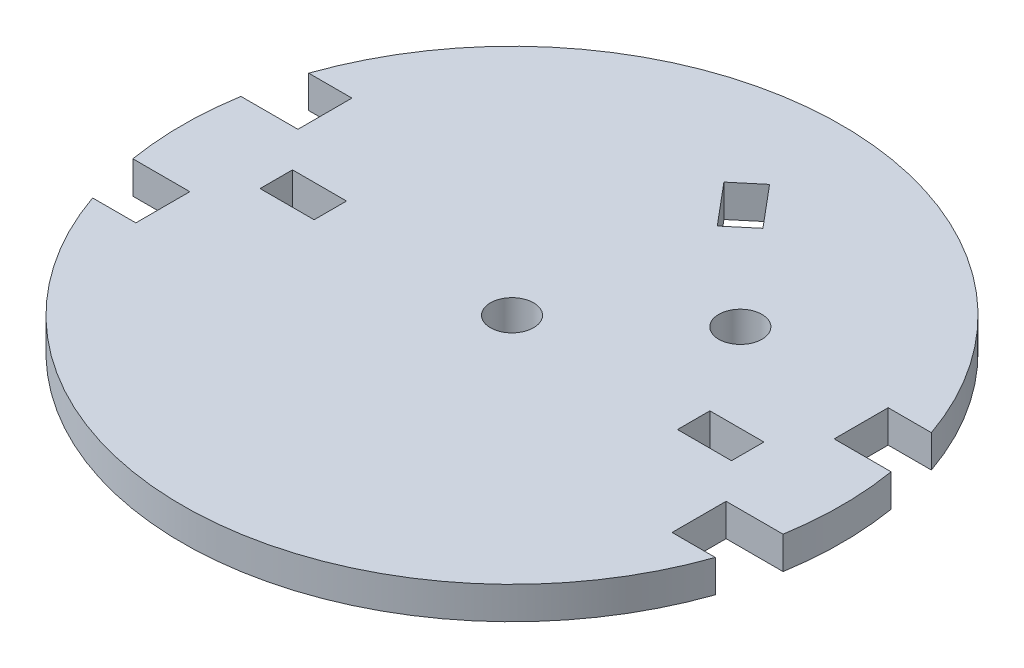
from build123d import *

# Parameters (mm, degrees)
CROQUIS1_R              = 30.5
SALIENTE_EXTRUIR1_DEPTH = 3
CROQUIS2_R              = 2
CORTAR_EXTRUIR1_DEPTH   = 4
CORTAR_EXTRUIR3_START   = -4
CORTAR_EXTRUIR3_DEPTH   = 4
CROQUIS6_W              = 5
CROQUIS6_H              = 3
CORTAR_EXTRUIR4_DEPTH   = 4
CROQUIS7_R              = 2
CORTAR_EXTRUIR5_DEPTH   = 4


with BuildPart() as part:
    # Croquis1 → Saliente-Extruir1 (new body)
    with BuildSketch(Plane(origin=(0, 0, 0), x_dir=(1, 0, 0), z_dir=(0, 1, 0))):
        with Locations(Location((0, 0, 0), (0, 0, 270))):
            Circle(CROQUIS1_R)
    extrude(amount=SALIENTE_EXTRUIR1_DEPTH)

    # Croquis2 → Cortar-Extruir1 (cut)
    with BuildSketch(Plane(origin=(0, 3, 0), x_dir=(1, 0, 0), z_dir=(0, 1, 0))):
        with Locations(Location((0, 0, 0), (0, 0, 270))):
            Circle(CROQUIS2_R)
    extrude(amount=-CORTAR_EXTRUIR1_DEPTH, mode=Mode.SUBTRACT)

    # Croquis5 → Cortar-Extruir3 (cut)
    with BuildSketch(Plane(origin=(0, 3, 0), x_dir=(1, 0, 0), z_dir=(0, 1, 0)).offset(CORTAR_EXTRUIR3_START)):
        with BuildLine():
            Line((28.814059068, 5), (30.087372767, 5))
            ThreePointArc((30.087372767, 5), (29.556634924, 7.526973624), (28.814059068, 10))
            Line((28.814059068, 10), (24.814059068, 10))
            Line((24.814059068, 10), (24.814059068, 5))
            Line((24.814059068, 5), (28.814059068, 5))
        make_face()
        with BuildLine():
            Line((30.087372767, -5), (28.814059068, -5))
            Line((28.814059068, -5), (24.814059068, -5))
            Line((24.814059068, -5), (24.814059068, -10))
            Line((24.814059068, -10), (28.814059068, -10))
            ThreePointArc((28.814059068, -10), (29.556634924, -7.526973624), (30.087372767, -5))
        make_face()
        with BuildLine():
            Line((-24.814059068, 5), (-24.814059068, 10))
            Line((-24.814059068, 10), (-28.814059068, 10))
            ThreePointArc((-28.814059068, 10), (-29.556634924, 7.526973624), (-30.087372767, 5))
            Line((-30.087372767, 5), (-28.814059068, 5))
            Line((-28.814059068, 5), (-24.814059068, 5))
        make_face()
        with BuildLine():
            Line((-28.814059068, -10), (-24.814059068, -10))
            Line((-24.814059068, -10), (-24.814059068, -5))
            Line((-24.814059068, -5), (-28.814059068, -5))
            Line((-28.814059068, -5), (-30.087372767, -5))
            ThreePointArc((-30.087372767, -5), (-29.556634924, -7.526973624), (-28.814059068, -10))
        make_face()
    extrude(amount=CORTAR_EXTRUIR3_DEPTH, mode=Mode.SUBTRACT)

    # Croquis6 → Cortar-Extruir4 (cut)
    with BuildSketch(Plane(origin=(0, 3, 0), x_dir=(1, 0, 0), z_dir=(0, 1, 0))):
        with Locations((-19.314059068, 0)):
            Rectangle(CROQUIS6_W, CROQUIS6_H)
        with Locations((19.314059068, 0)):
            Rectangle(CROQUIS6_W, CROQUIS6_H)
    extrude(amount=-CORTAR_EXTRUIR4_DEPTH, mode=Mode.SUBTRACT)

    # Croquis7 → Cortar-Extruir5 (cut)
    with BuildSketch(Plane(origin=(0, 3, 0), x_dir=(1, 0, 0), z_dir=(0, 1, 0))):
        with Locations(Location((11.490666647, 9.641814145, 0), (0, 0, 270))):
            Circle(CROQUIS7_R)
        Polygon((1.428390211, 22.411430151), (-0.869743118, 20.483067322), (2.34419493, 16.652845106), (4.642328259, 18.581207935), align=None)
    extrude(amount=-CORTAR_EXTRUIR5_DEPTH, mode=Mode.SUBTRACT)


solid = part.part
